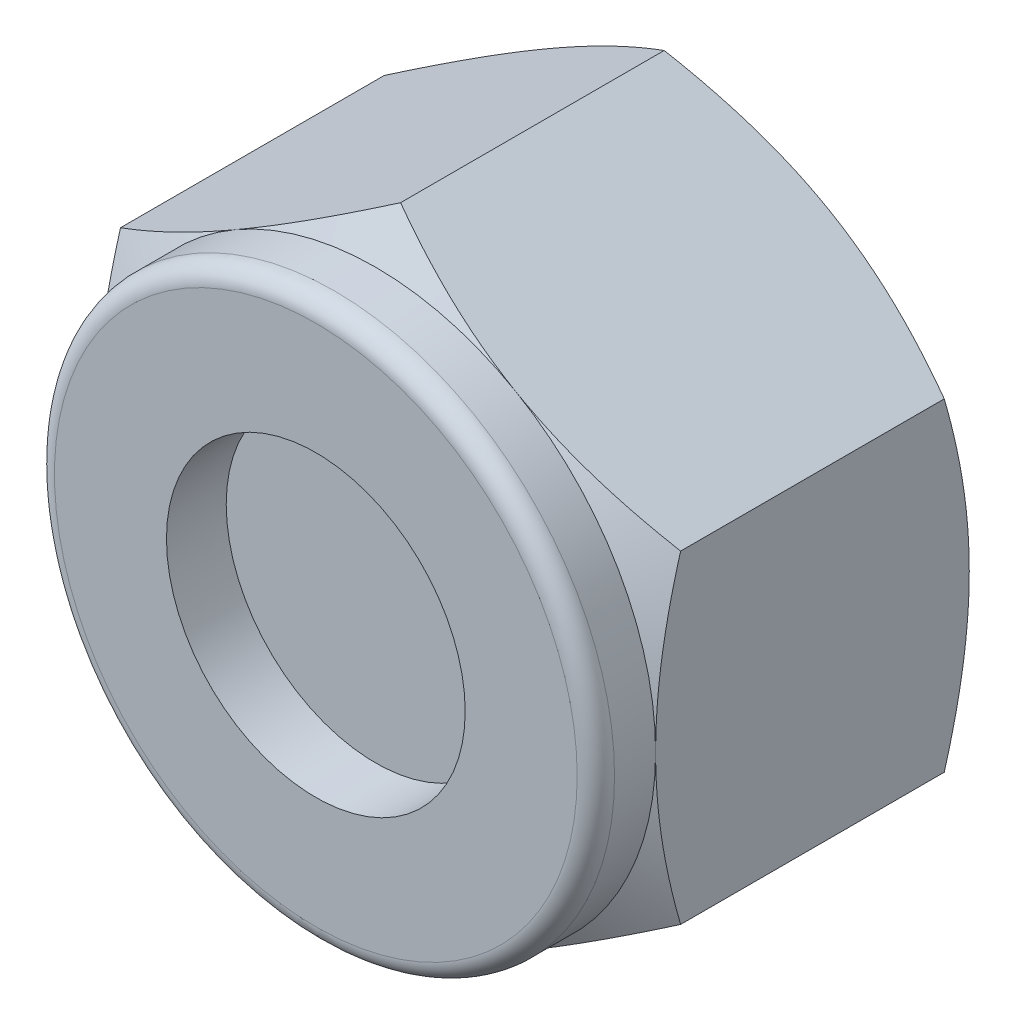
ISO-10303-21;
HEADER;
FILE_DESCRIPTION(('STEP AP214'),'2;1');
FILE_NAME('part.step','',(''),(''),'','','');
FILE_SCHEMA(('AUTOMOTIVE_DESIGN { 1 0 10303 214 1 1 1 1 }'));
ENDSEC;
DATA;
#1=APPLICATION_CONTEXT('core data for automotive mechanical design processes');
#2=APPLICATION_PROTOCOL_DEFINITION('international standard','automotive_design',2000,#1);
#3=PRODUCT_CONTEXT('',#1,'mechanical');
#4=PRODUCT('Part','Part','',(#3));
#5=PRODUCT_RELATED_PRODUCT_CATEGORY('part','',(#4));
#6=PRODUCT_DEFINITION_FORMATION('','',#4);
#7=PRODUCT_DEFINITION_CONTEXT('part definition',#1,'design');
#8=PRODUCT_DEFINITION('design','',#6,#7);
#9=PRODUCT_DEFINITION_SHAPE('','',#8);
#10=(LENGTH_UNIT() NAMED_UNIT(*) SI_UNIT(.MILLI.,.METRE.));
#11=(NAMED_UNIT(*) PLANE_ANGLE_UNIT() SI_UNIT($,.RADIAN.));
#12=(NAMED_UNIT(*) SI_UNIT($,.STERADIAN.) SOLID_ANGLE_UNIT());
#13=UNCERTAINTY_MEASURE_WITH_UNIT(LENGTH_MEASURE(1.E-05),#10,'distance_accuracy_value','');
#14=(GEOMETRIC_REPRESENTATION_CONTEXT(3) GLOBAL_UNCERTAINTY_ASSIGNED_CONTEXT((#13)) GLOBAL_UNIT_ASSIGNED_CONTEXT((#10,
#11,#12)) REPRESENTATION_CONTEXT('',''));
#15=CARTESIAN_POINT('',(0.,0.,0.));
#16=DIRECTION('',(0.,0.,1.));
#17=DIRECTION('',(1.,0.,0.));
#18=AXIS2_PLACEMENT_3D('',#15,#16,#17);
#19=CARTESIAN_POINT('',(0.,0.,10.));
#20=DIRECTION('',(0.,0.,-1.));
#21=DIRECTION('',(-1.,0.,0.));
#22=AXIS2_PLACEMENT_3D('',#19,#20,#21);
#23=CYLINDRICAL_SURFACE('',#22,7.5);
#24=CARTESIAN_POINT('',(0.,0.,9.5));
#25=DIRECTION('',(0.,0.,1.));
#26=DIRECTION('',(1.,0.,0.));
#27=AXIS2_PLACEMENT_3D('',#24,#25,#26);
#28=CIRCLE('',#27,7.5);
#29=CARTESIAN_POINT('',(7.5,0.,9.5));
#30=VERTEX_POINT('',#29);
#31=EDGE_CURVE('E11',#30,#30,#28,.F.);
#32=ORIENTED_EDGE('',*,*,#31,.T.);
#33=EDGE_LOOP('',(#32));
#34=FACE_BOUND('',#33,.T.);
#35=CARTESIAN_POINT('',(0.,0.,8.4));
#36=DIRECTION('',(0.,0.,-1.));
#37=DIRECTION('',(-1.,0.,0.));
#38=AXIS2_PLACEMENT_3D('',#35,#36,#37);
#39=CIRCLE('',#38,7.5);
#40=CARTESIAN_POINT('',(-7.5,0.,8.4));
#41=VERTEX_POINT('',#40);
#42=CARTESIAN_POINT('',(-3.75000000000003,6.49519052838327,8.4));
#43=VERTEX_POINT('',#42);
#44=EDGE_CURVE('E298',#41,#43,#39,.T.);
#45=ORIENTED_EDGE('',*,*,#44,.F.);
#46=CARTESIAN_POINT('',(-3.75000000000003,-6.49519052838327,8.4));
#47=VERTEX_POINT('',#46);
#48=EDGE_CURVE('E289',#47,#41,#39,.T.);
#49=ORIENTED_EDGE('',*,*,#48,.F.);
#50=CARTESIAN_POINT('',(3.75000000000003,-6.49519052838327,8.4));
#51=VERTEX_POINT('',#50);
#52=EDGE_CURVE('E297',#51,#47,#39,.T.);
#53=ORIENTED_EDGE('',*,*,#52,.F.);
#54=CARTESIAN_POINT('',(7.5,0.,8.4));
#55=VERTEX_POINT('',#54);
#56=EDGE_CURVE('E340',#55,#51,#39,.T.);
#57=ORIENTED_EDGE('',*,*,#56,.F.);
#58=CARTESIAN_POINT('',(3.75000000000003,6.49519052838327,8.4));
#59=VERTEX_POINT('',#58);
#60=EDGE_CURVE('E517',#59,#55,#39,.T.);
#61=ORIENTED_EDGE('',*,*,#60,.F.);
#62=EDGE_CURVE('E326',#43,#59,#39,.T.);
#63=ORIENTED_EDGE('',*,*,#62,.F.);
#64=EDGE_LOOP('',(#45,#49,#53,#57,#61,#63));
#65=FACE_BOUND('',#64,.T.);
#66=ADVANCED_FACE('F29',(#34,#65),#23,.T.);
#67=CARTESIAN_POINT('',(0.,0.,10.));
#68=DIRECTION('',(0.,0.,-1.));
#69=DIRECTION('',(-1.,0.,0.));
#70=AXIS2_PLACEMENT_3D('',#67,#68,#69);
#71=CYLINDRICAL_SURFACE('',#70,4.);
#72=CARTESIAN_POINT('',(0.,0.,10.));
#73=DIRECTION('',(0.,0.,1.));
#74=DIRECTION('',(1.,0.,0.));
#75=AXIS2_PLACEMENT_3D('',#72,#73,#74);
#76=CIRCLE('',#75,4.);
#77=CARTESIAN_POINT('',(4.,0.,10.));
#78=VERTEX_POINT('',#77);
#79=EDGE_CURVE('E146',#78,#78,#76,.T.);
#80=ORIENTED_EDGE('',*,*,#79,.T.);
#81=EDGE_LOOP('',(#80));
#82=FACE_BOUND('',#81,.T.);
#83=CARTESIAN_POINT('',(0.,0.,8.4));
#84=DIRECTION('',(0.,0.,-1.));
#85=DIRECTION('',(-1.,0.,0.));
#86=AXIS2_PLACEMENT_3D('',#83,#84,#85);
#87=CIRCLE('',#86,4.);
#88=CARTESIAN_POINT('',(-4.,0.,8.4));
#89=VERTEX_POINT('',#88);
#90=EDGE_CURVE('E285',#89,#89,#87,.T.);
#91=ORIENTED_EDGE('',*,*,#90,.T.);
#92=EDGE_LOOP('',(#91));
#93=FACE_BOUND('',#92,.T.);
#94=ADVANCED_FACE('F314',(#82,#93),#71,.F.);
#95=CARTESIAN_POINT('',(0.,0.,10.));
#96=DIRECTION('',(0.,0.,1.));
#97=DIRECTION('',(1.,0.,0.));
#98=AXIS2_PLACEMENT_3D('',#95,#96,#97);
#99=PLANE('',#98);
#100=CARTESIAN_POINT('',(0.,0.,10.));
#101=DIRECTION('',(0.,0.,1.));
#102=DIRECTION('',(1.,0.,0.));
#103=AXIS2_PLACEMENT_3D('',#100,#101,#102);
#104=CIRCLE('',#103,7.);
#105=CARTESIAN_POINT('',(7.,0.,10.));
#106=VERTEX_POINT('',#105);
#107=EDGE_CURVE('E36',#106,#106,#104,.T.);
#108=ORIENTED_EDGE('',*,*,#107,.T.);
#109=EDGE_LOOP('',(#108));
#110=FACE_BOUND('',#109,.T.);
#111=ORIENTED_EDGE('',*,*,#79,.F.);
#112=EDGE_LOOP('',(#111));
#113=FACE_BOUND('',#112,.T.);
#114=ADVANCED_FACE('F303',(#110,#113),#99,.T.);
#115=CARTESIAN_POINT('',(-14.9999999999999,0.,8.4));
#116=DIRECTION('',(0.,0.,-1.));
#117=DIRECTION('',(-1.,0.,0.));
#118=AXIS2_PLACEMENT_3D('',#115,#116,#117);
#119=PLANE('',#118);
#120=ORIENTED_EDGE('',*,*,#90,.F.);
#121=EDGE_LOOP('',(#120));
#122=FACE_BOUND('',#121,.T.);
#123=ADVANCED_FACE('F357',(#122),#119,.F.);
#124=CARTESIAN_POINT('',(0.,0.,5.2245735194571));
#125=DIRECTION('',(0.,0.,-1.));
#126=DIRECTION('',(-1.,0.,0.));
#127=AXIS2_PLACEMENT_3D('',#124,#125,#126);
#128=CONICAL_SURFACE('',#127,13.,1.0471975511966);
#129=CARTESIAN_POINT('',(-7.49999999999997,-11.8353110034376,4.64053315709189));
#130=CARTESIAN_POINT('',(-7.49999999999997,-11.5059778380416,4.80109906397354));
#131=CARTESIAN_POINT('',(-7.49999999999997,-11.1759102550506,4.96018336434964));
#132=CARTESIAN_POINT('',(-7.49999999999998,-10.513916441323,5.27455938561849));
#133=CARTESIAN_POINT('',(-7.49999999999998,-10.1819899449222,5.42985054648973));
#134=CARTESIAN_POINT('',(-7.49999999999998,-9.51427396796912,5.73654919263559));
#135=CARTESIAN_POINT('',(-7.49999999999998,-9.17847340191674,5.88793262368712));
#136=CARTESIAN_POINT('',(-7.49999999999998,-8.50427203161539,6.18477140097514));
#137=CARTESIAN_POINT('',(-7.49999999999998,-8.1658713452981,6.33022701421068));
#138=CARTESIAN_POINT('',(-7.49999999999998,-7.47423621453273,6.61852702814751));
#139=CARTESIAN_POINT('',(-7.49999999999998,-7.12089197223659,6.76110942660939));
#140=CARTESIAN_POINT('',(-7.49999999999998,-6.41014637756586,7.03596896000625));
#141=CARTESIAN_POINT('',(-7.49999999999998,-6.05274458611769,7.16824496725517));
#142=CARTESIAN_POINT('',(-7.49999999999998,-5.3339166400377,7.41916746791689));
#143=CARTESIAN_POINT('',(-7.49999999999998,-4.97249963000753,7.53783988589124));
#144=CARTESIAN_POINT('',(-7.49999999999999,-4.24449734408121,7.75788377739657));
#145=CARTESIAN_POINT('',(-7.49999999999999,-3.87791366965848,7.85926048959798));
#146=CARTESIAN_POINT('',(-7.49999999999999,-3.14139472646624,8.03942667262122));
#147=CARTESIAN_POINT('',(-7.49999999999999,-2.77149219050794,8.11834642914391));
#148=CARTESIAN_POINT('',(-7.49999999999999,-2.21311238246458,8.21657739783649));
#149=CARTESIAN_POINT('',(-7.49999999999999,-2.02638580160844,8.24596420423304));
#150=CARTESIAN_POINT('',(-7.49999999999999,-1.65193680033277,8.29745076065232));
#151=CARTESIAN_POINT('',(-7.49999999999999,-1.46421447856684,8.31955121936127));
#152=CARTESIAN_POINT('',(-7.49999999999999,-1.09056588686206,8.35573656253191));
#153=CARTESIAN_POINT('',(-7.49999999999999,-0.904649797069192,8.36992611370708));
#154=CARTESIAN_POINT('',(-7.49999999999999,-0.532383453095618,8.39042247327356));
#155=CARTESIAN_POINT('',(-7.49999999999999,-0.346033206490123,8.39672941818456));
#156=CARTESIAN_POINT('',(-7.49999999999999,0.0267671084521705,8.4013091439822));
#157=CARTESIAN_POINT('',(-7.49999999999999,0.213217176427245,8.39958195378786));
#158=CARTESIAN_POINT('',(-7.49999999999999,0.58587403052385,8.38813791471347));
#159=CARTESIAN_POINT('',(-7.49999999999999,0.772080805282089,8.37842070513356));
#160=CARTESIAN_POINT('',(-7.49999999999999,1.21356317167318,8.34612022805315));
#161=CARTESIAN_POINT('',(-7.49999999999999,1.46859186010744,8.3200816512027));
#162=CARTESIAN_POINT('',(-7.5,1.97687612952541,8.25439255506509));
#163=CARTESIAN_POINT('',(-7.5,2.23013148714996,8.21474035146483));
#164=CARTESIAN_POINT('',(-7.5,2.98688160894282,8.07745582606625));
#165=CARTESIAN_POINT('',(-7.5,3.4871060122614,7.96151677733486));
#166=CARTESIAN_POINT('',(-7.5,4.23534945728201,7.75894108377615));
#167=CARTESIAN_POINT('',(-7.5,4.48720749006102,7.68565475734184));
#168=CARTESIAN_POINT('',(-7.5,4.98848200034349,7.53108602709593));
#169=CARTESIAN_POINT('',(-7.5,5.23789846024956,7.44980356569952));
#170=CARTESIAN_POINT('',(-7.5,5.73436090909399,7.28057821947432));
#171=CARTESIAN_POINT('',(-7.5,5.98140755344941,7.19263723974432));
#172=CARTESIAN_POINT('',(-7.5,6.47342859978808,7.01116763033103));
#173=CARTESIAN_POINT('',(-7.5,6.71840303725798,6.91763909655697));
#174=CARTESIAN_POINT('',(-7.5,7.33598157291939,6.67505952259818));
#175=CARTESIAN_POINT('',(-7.50000000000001,7.70735302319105,6.52287454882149));
#176=CARTESIAN_POINT('',(-7.50000000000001,8.44656287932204,6.21012528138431));
#177=CARTESIAN_POINT('',(-7.50000000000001,8.81440097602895,6.04956026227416));
#178=CARTESIAN_POINT('',(-7.50000000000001,9.54727427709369,5.72187695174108));
#179=CARTESIAN_POINT('',(-7.50000000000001,9.91230857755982,5.55475664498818));
#180=CARTESIAN_POINT('',(-7.50000000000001,10.6399735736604,5.21540661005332));
#181=CARTESIAN_POINT('',(-7.50000000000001,11.0026043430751,5.04317703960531));
#182=CARTESIAN_POINT('',(-7.50000000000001,11.7263998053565,4.69440091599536));
#183=CARTESIAN_POINT('',(-7.50000000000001,12.0875617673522,4.51784870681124));
#184=CARTESIAN_POINT('',(-7.50000000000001,12.8082552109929,4.16144684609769));
#185=CARTESIAN_POINT('',(-7.50000000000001,13.1677866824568,3.98159717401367));
#186=CARTESIAN_POINT('',(-7.50000000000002,13.8854257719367,3.61924007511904));
#187=CARTESIAN_POINT('',(-7.50000000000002,14.2435336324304,3.43673312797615));
#188=CARTESIAN_POINT('',(-7.50000000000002,14.9586085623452,3.06949663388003));
#189=CARTESIAN_POINT('',(-7.50000000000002,15.3155756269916,2.8847670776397));
#190=CARTESIAN_POINT('',(-7.50000000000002,16.3172991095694,2.36309010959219));
#191=CARTESIAN_POINT('',(-7.50000000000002,16.9609630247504,2.02404516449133));
#192=CARTESIAN_POINT('',(-7.50000000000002,18.245962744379,1.34150647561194));
#193=CARTESIAN_POINT('',(-7.50000000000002,18.8872984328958,0.998012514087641));
#194=CARTESIAN_POINT('',(-7.50000000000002,20.1662212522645,0.308722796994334));
#195=CARTESIAN_POINT('',(-7.50000000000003,20.8038138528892,-0.0370628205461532));
#196=CARTESIAN_POINT('',(-7.50000000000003,22.0775296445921,-0.731227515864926));
#197=CARTESIAN_POINT('',(-7.50000000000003,22.7136529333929,-1.07960641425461));
#198=CARTESIAN_POINT('',(-7.50000000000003,23.3492483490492,-1.4289383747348));
#199=B_SPLINE_CURVE_WITH_KNOTS('',3,(#129,#130,#131,#132,#133,#134,#135,#136,#137,#138,#139,
#140,#141,#142,#143,#144,#145,#146,#147,#148,#149,#150,#151,#152,#153,#154,#155,#156,#157,#158,
#159,#160,#161,#162,#163,#164,#165,#166,#167,#168,#169,#170,#171,#172,#173,#174,#175,#176,#177,
#178,#179,#180,#181,#182,#183,#184,#185,#186,#187,#188,#189,#190,#191,#192,#193,#194,#195,#196,
#197,#198),.UNSPECIFIED.,.F.,.F.,(4,2,2,2,2,2,2,2,2,2,2,2,2,2,2,2,2,2,2,2,2,2,2,2,2,2,2,2,2,2,2,
2,2,2,4),(0.,1.09918292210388,2.19852715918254,3.30351989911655,4.40846281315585,
5.5514201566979,6.69450238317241,7.83536867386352,8.97588879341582,10.1096505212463,
10.676605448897,11.2435052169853,11.8027148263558,12.3619147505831,12.9211126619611,
13.4803358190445,14.2489692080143,15.0176977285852,16.5559171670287,17.3427576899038,
18.1296038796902,18.9162257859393,19.7028341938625,20.9067203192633,22.1107108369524,
23.3150744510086,24.5194009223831,25.7253976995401,26.9314019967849,28.137191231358,
29.3429855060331,31.5254556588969,33.7080330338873,35.8839922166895,38.0598022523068),.UNSPECIFIED.);
#200=CARTESIAN_POINT('',(-7.49999999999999,-4.33012701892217,7.73012701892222));
#201=VERTEX_POINT('',#200);
#202=EDGE_CURVE('E225',#41,#201,#199,.F.);
#203=ORIENTED_EDGE('',*,*,#202,.T.);
#204=CARTESIAN_POINT('',(-7.50019999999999,-4.33001154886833,7.73006035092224));
#205=CARTESIAN_POINT('',(-7.33534165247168,-4.42519256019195,7.78500472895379));
#206=CARTESIAN_POINT('',(-7.16986863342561,-4.52072845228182,7.83745551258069));
#207=CARTESIAN_POINT('',(-6.83757877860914,-4.7125760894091,7.93668310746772));
#208=CARTESIAN_POINT('',(-6.67076139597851,-4.8088881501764,7.98345747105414));
#209=CARTESIAN_POINT('',(-6.16763831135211,-5.09936639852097,8.11434781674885));
#210=CARTESIAN_POINT('',(-5.82934661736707,-5.29467919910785,8.18879669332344));
#211=CARTESIAN_POINT('',(-5.32309925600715,-5.58696124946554,8.2760966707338));
#212=CARTESIAN_POINT('',(-5.15665618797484,-5.68305719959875,8.30096588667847));
#213=CARTESIAN_POINT('',(-4.82301799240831,-5.87568330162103,8.342667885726));
#214=CARTESIAN_POINT('',(-4.65582293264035,-5.97221341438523,8.35950137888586));
#215=CARTESIAN_POINT('',(-4.32114243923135,-6.16544128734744,8.38470292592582));
#216=CARTESIAN_POINT('',(-4.15365755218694,-6.26213873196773,8.39308058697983));
#217=CARTESIAN_POINT('',(-3.81854232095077,-6.45561760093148,8.40119981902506));
#218=CARTESIAN_POINT('',(-3.65091198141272,-6.55239902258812,8.40094165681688));
#219=CARTESIAN_POINT('',(-3.19166219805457,-6.81754700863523,8.38836399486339));
#220=CARTESIAN_POINT('',(-2.90019309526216,-6.98582677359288,8.36725033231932));
#221=CARTESIAN_POINT('',(-2.3191907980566,-7.32126860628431,8.30029942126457));
#222=CARTESIAN_POINT('',(-2.02965964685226,-7.48842949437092,8.25443929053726));
#223=CARTESIAN_POINT('',(-1.44748813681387,-7.82454637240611,8.13980254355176));
#224=CARTESIAN_POINT('',(-1.15492123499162,-7.99345995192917,8.07054023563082));
#225=CARTESIAN_POINT('',(-0.574150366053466,-8.32876816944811,7.91334284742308));
#226=CARTESIAN_POINT('',(-0.28593896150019,-8.49516710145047,7.8254446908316));
#227=CARTESIAN_POINT('',(0.000200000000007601,-8.66036950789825,7.73006035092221));
#228=B_SPLINE_CURVE_WITH_KNOTS('',3,(#204,#205,#206,#207,#208,#209,#210,#211,#212,#213,#214,
#215,#216,#217,#218,#219,#220,#221,#222,#223,#224,#225,#226,#227),.UNSPECIFIED.,.F.,.F.,(4,2,2,
2,2,2,2,2,2,2,2,4),(0.,0.594350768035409,1.18895691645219,2.38063993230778,2.96188692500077,
3.5430825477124,4.12361709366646,4.70413370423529,5.7147367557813,6.7262758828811,
7.76024925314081,8.79219281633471),.UNSPECIFIED.);
#229=EDGE_CURVE('E231',#201,#47,#228,.T.);
#230=ORIENTED_EDGE('',*,*,#229,.T.);
#231=ORIENTED_EDGE('',*,*,#48,.T.);
#232=EDGE_LOOP('',(#203,#230,#231));
#233=FACE_BOUND('',#232,.T.);
#234=ADVANCED_FACE('F331',(#233),#128,.T.);
#235=CARTESIAN_POINT('',(0.,-8.66025403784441,7.73012701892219));
#236=VERTEX_POINT('',#235);
#237=EDGE_CURVE('E220',#47,#236,#228,.T.);
#238=ORIENTED_EDGE('',*,*,#237,.T.);
#239=CARTESIAN_POINT('',(-0.000199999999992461,-8.66036950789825,7.73006035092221));
#240=CARTESIAN_POINT('',(0.16465834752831,-8.56518849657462,7.78500472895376));
#241=CARTESIAN_POINT('',(0.330131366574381,-8.46965260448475,7.83745551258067));
#242=CARTESIAN_POINT('',(0.662421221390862,-8.27780496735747,7.9366831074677));
#243=CARTESIAN_POINT('',(0.829238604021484,-8.18149290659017,7.98345747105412));
#244=CARTESIAN_POINT('',(1.33236168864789,-7.8910146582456,8.11434781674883));
#245=CARTESIAN_POINT('',(1.67065338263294,-7.69570185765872,8.18879669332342));
#246=CARTESIAN_POINT('',(2.17690074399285,-7.40341980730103,8.27609667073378));
#247=CARTESIAN_POINT('',(2.34334381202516,-7.30732385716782,8.30096588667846));
#248=CARTESIAN_POINT('',(2.6769820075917,-7.11469775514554,8.34266788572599));
#249=CARTESIAN_POINT('',(2.84417706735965,-7.01816764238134,8.35950137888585));
#250=CARTESIAN_POINT('',(3.17885756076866,-6.82493976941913,8.38470292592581));
#251=CARTESIAN_POINT('',(3.34634244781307,-6.72824232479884,8.39308058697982));
#252=CARTESIAN_POINT('',(3.68145767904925,-6.53476345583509,8.40119981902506));
#253=CARTESIAN_POINT('',(3.8490880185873,-6.43798203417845,8.40094165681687));
#254=CARTESIAN_POINT('',(4.30833780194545,-6.17283404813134,8.38836399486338));
#255=CARTESIAN_POINT('',(4.59980690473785,-6.00455428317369,8.36725033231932));
#256=CARTESIAN_POINT('',(5.18080920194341,-5.66911245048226,8.30029942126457));
#257=CARTESIAN_POINT('',(5.47034035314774,-5.50195156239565,8.25443929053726));
#258=CARTESIAN_POINT('',(6.05251186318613,-5.16583468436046,8.13980254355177));
#259=CARTESIAN_POINT('',(6.34507876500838,-4.99692110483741,8.07054023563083));
#260=CARTESIAN_POINT('',(6.92584963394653,-4.66161288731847,7.91334284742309));
#261=CARTESIAN_POINT('',(7.21406103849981,-4.49521395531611,7.82544469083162));
#262=CARTESIAN_POINT('',(7.5002,-4.33001154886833,7.73006035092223));
#263=B_SPLINE_CURVE_WITH_KNOTS('',3,(#239,#240,#241,#242,#243,#244,#245,#246,#247,#248,#249,
#250,#251,#252,#253,#254,#255,#256,#257,#258,#259,#260,#261,#262),.UNSPECIFIED.,.F.,.F.,(4,2,2,
2,2,2,2,2,2,2,2,4),(0.,0.594350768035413,1.1889569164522,2.38063993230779,2.96188692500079,
3.54308254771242,4.12361709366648,4.70413370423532,5.71473675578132,6.72627588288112,
7.76024925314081,8.79219281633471),.UNSPECIFIED.);
#264=EDGE_CURVE('E334',#236,#51,#263,.T.);
#265=ORIENTED_EDGE('',*,*,#264,.T.);
#266=ORIENTED_EDGE('',*,*,#52,.T.);
#267=EDGE_LOOP('',(#238,#265,#266));
#268=FACE_BOUND('',#267,.T.);
#269=ADVANCED_FACE('F356',(#268),#128,.T.);
#270=CARTESIAN_POINT('',(7.5,-4.33012701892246,7.7301270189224));
#271=VERTEX_POINT('',#270);
#272=EDGE_CURVE('E202',#51,#271,#263,.T.);
#273=ORIENTED_EDGE('',*,*,#272,.T.);
#274=CARTESIAN_POINT('',(7.50000000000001,-11.8353110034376,4.64053315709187));
#275=CARTESIAN_POINT('',(7.50000000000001,-11.5059778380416,4.80109906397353));
#276=CARTESIAN_POINT('',(7.50000000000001,-11.1759102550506,4.96018336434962));
#277=CARTESIAN_POINT('',(7.50000000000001,-10.513916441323,5.27455938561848));
#278=CARTESIAN_POINT('',(7.50000000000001,-10.1819899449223,5.42985054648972));
#279=CARTESIAN_POINT('',(7.50000000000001,-9.51427396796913,5.73654919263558));
#280=CARTESIAN_POINT('',(7.50000000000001,-9.17847340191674,5.88793262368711));
#281=CARTESIAN_POINT('',(7.50000000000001,-8.50427203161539,6.18477140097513));
#282=CARTESIAN_POINT('',(7.50000000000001,-8.16587134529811,6.33022701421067));
#283=CARTESIAN_POINT('',(7.50000000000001,-7.47423621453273,6.6185270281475));
#284=CARTESIAN_POINT('',(7.5,-7.12089197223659,6.76110942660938));
#285=CARTESIAN_POINT('',(7.5,-6.41014637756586,7.03596896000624));
#286=CARTESIAN_POINT('',(7.5,-6.05274458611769,7.16824496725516));
#287=CARTESIAN_POINT('',(7.5,-5.3339166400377,7.41916746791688));
#288=CARTESIAN_POINT('',(7.5,-4.97249963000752,7.53783988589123));
#289=CARTESIAN_POINT('',(7.5,-4.2444973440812,7.75788377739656));
#290=CARTESIAN_POINT('',(7.5,-3.87791366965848,7.85926048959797));
#291=CARTESIAN_POINT('',(7.5,-3.14139472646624,8.03942667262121));
#292=CARTESIAN_POINT('',(7.5,-2.77149219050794,8.1183464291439));
#293=CARTESIAN_POINT('',(7.5,-2.21311238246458,8.21657739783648));
#294=CARTESIAN_POINT('',(7.5,-2.02638580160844,8.24596420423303));
#295=CARTESIAN_POINT('',(7.5,-1.65193680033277,8.29745076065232));
#296=CARTESIAN_POINT('',(7.5,-1.46421447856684,8.31955121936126));
#297=CARTESIAN_POINT('',(7.5,-1.09056588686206,8.35573656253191));
#298=CARTESIAN_POINT('',(7.5,-0.904649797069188,8.36992611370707));
#299=CARTESIAN_POINT('',(7.5,-0.532383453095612,8.39042247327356));
#300=CARTESIAN_POINT('',(7.5,-0.346033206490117,8.39672941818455));
#301=CARTESIAN_POINT('',(7.5,0.0267671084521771,8.40130914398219));
#302=CARTESIAN_POINT('',(7.5,0.213217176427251,8.39958195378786));
#303=CARTESIAN_POINT('',(7.5,0.585874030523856,8.38813791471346));
#304=CARTESIAN_POINT('',(7.5,0.772080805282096,8.37842070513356));
#305=CARTESIAN_POINT('',(7.5,1.21356317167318,8.34612022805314));
#306=CARTESIAN_POINT('',(7.5,1.46859186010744,8.32008165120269));
#307=CARTESIAN_POINT('',(7.5,1.97687612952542,8.25439255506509));
#308=CARTESIAN_POINT('',(7.5,2.23013148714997,8.21474035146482));
#309=CARTESIAN_POINT('',(7.5,2.98688160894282,8.07745582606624));
#310=CARTESIAN_POINT('',(7.5,3.48710601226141,7.96151677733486));
#311=CARTESIAN_POINT('',(7.5,4.23534945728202,7.75894108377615));
#312=CARTESIAN_POINT('',(7.5,4.48720749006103,7.68565475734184));
#313=CARTESIAN_POINT('',(7.5,4.9884820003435,7.53108602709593));
#314=CARTESIAN_POINT('',(7.5,5.23789846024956,7.44980356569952));
#315=CARTESIAN_POINT('',(7.5,5.73436090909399,7.28057821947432));
#316=CARTESIAN_POINT('',(7.5,5.98140755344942,7.19263723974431));
#317=CARTESIAN_POINT('',(7.5,6.47342859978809,7.01116763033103));
#318=CARTESIAN_POINT('',(7.5,6.71840303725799,6.91763909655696));
#319=CARTESIAN_POINT('',(7.5,7.3359815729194,6.67505952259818));
#320=CARTESIAN_POINT('',(7.5,7.70735302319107,6.52287454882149));
#321=CARTESIAN_POINT('',(7.5,8.44656287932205,6.2101252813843));
#322=CARTESIAN_POINT('',(7.5,8.81440097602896,6.04956026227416));
#323=CARTESIAN_POINT('',(7.5,9.54727427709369,5.72187695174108));
#324=CARTESIAN_POINT('',(7.5,9.91230857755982,5.55475664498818));
#325=CARTESIAN_POINT('',(7.5,10.6399735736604,5.21540661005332));
#326=CARTESIAN_POINT('',(7.5,11.0026043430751,5.04317703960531));
#327=CARTESIAN_POINT('',(7.5,11.7263998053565,4.69440091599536));
#328=CARTESIAN_POINT('',(7.5,12.0875617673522,4.51784870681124));
#329=CARTESIAN_POINT('',(7.5,12.8082552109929,4.16144684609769));
#330=CARTESIAN_POINT('',(7.5,13.1677866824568,3.98159717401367));
#331=CARTESIAN_POINT('',(7.5,13.8854257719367,3.61924007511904));
#332=CARTESIAN_POINT('',(7.5,14.2435336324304,3.43673312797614));
#333=CARTESIAN_POINT('',(7.5,14.9586085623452,3.06949663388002));
#334=CARTESIAN_POINT('',(7.5,15.3155756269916,2.8847670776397));
#335=CARTESIAN_POINT('',(7.5,16.3172991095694,2.36309010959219));
#336=CARTESIAN_POINT('',(7.49999999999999,16.9609630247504,2.02404516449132));
#337=CARTESIAN_POINT('',(7.49999999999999,18.2459627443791,1.34150647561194));
#338=CARTESIAN_POINT('',(7.49999999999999,18.8872984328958,0.998012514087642));
#339=CARTESIAN_POINT('',(7.49999999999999,20.1662212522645,0.308722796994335));
#340=CARTESIAN_POINT('',(7.49999999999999,20.8038138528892,-0.0370628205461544));
#341=CARTESIAN_POINT('',(7.49999999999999,22.0775296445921,-0.731227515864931));
#342=CARTESIAN_POINT('',(7.49999999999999,22.7136529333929,-1.07960641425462));
#343=CARTESIAN_POINT('',(7.49999999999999,23.3492483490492,-1.4289383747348));
#344=B_SPLINE_CURVE_WITH_KNOTS('',3,(#274,#275,#276,#277,#278,#279,#280,#281,#282,#283,#284,
#285,#286,#287,#288,#289,#290,#291,#292,#293,#294,#295,#296,#297,#298,#299,#300,#301,#302,#303,
#304,#305,#306,#307,#308,#309,#310,#311,#312,#313,#314,#315,#316,#317,#318,#319,#320,#321,#322,
#323,#324,#325,#326,#327,#328,#329,#330,#331,#332,#333,#334,#335,#336,#337,#338,#339,#340,#341,
#342,#343),.UNSPECIFIED.,.F.,.F.,(4,2,2,2,2,2,2,2,2,2,2,2,2,2,2,2,2,2,2,2,2,2,2,2,2,2,2,2,2,2,2,
2,2,2,4),(0.,1.09918292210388,2.19852715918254,3.30351989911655,4.40846281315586,
5.55142015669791,6.69450238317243,7.83536867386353,8.97588879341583,10.1096505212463,
10.676605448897,11.2435052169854,11.8027148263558,12.3619147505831,12.9211126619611,
13.4803358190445,14.2489692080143,15.0176977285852,16.5559171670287,17.3427576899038,
18.1296038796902,18.9162257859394,19.7028341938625,20.9067203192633,22.1107108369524,
23.3150744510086,24.5194009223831,25.7253976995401,26.9314019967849,28.137191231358,
29.3429855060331,31.5254556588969,33.7080330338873,35.8839922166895,38.0598022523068),.UNSPECIFIED.);
#345=EDGE_CURVE('E51',#271,#55,#344,.T.);
#346=ORIENTED_EDGE('',*,*,#345,.T.);
#347=ORIENTED_EDGE('',*,*,#56,.T.);
#348=EDGE_LOOP('',(#273,#346,#347));
#349=FACE_BOUND('',#348,.T.);
#350=ADVANCED_FACE('F338',(#349),#128,.T.);
#351=CARTESIAN_POINT('',(7.5,4.33012701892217,7.73012701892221));
#352=VERTEX_POINT('',#351);
#353=EDGE_CURVE('E190',#55,#352,#344,.T.);
#354=ORIENTED_EDGE('',*,*,#353,.T.);
#355=CARTESIAN_POINT('',(7.5002,4.33001154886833,7.73006035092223));
#356=CARTESIAN_POINT('',(7.3353416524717,4.42519256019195,7.78500472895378));
#357=CARTESIAN_POINT('',(7.16986863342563,4.52072845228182,7.83745551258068));
#358=CARTESIAN_POINT('',(6.83757877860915,4.7125760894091,7.93668310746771));
#359=CARTESIAN_POINT('',(6.67076139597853,4.8088881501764,7.98345747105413));
#360=CARTESIAN_POINT('',(6.16763831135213,5.09936639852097,8.11434781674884));
#361=CARTESIAN_POINT('',(5.82934661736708,5.29467919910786,8.18879669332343));
#362=CARTESIAN_POINT('',(5.32309925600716,5.58696124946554,8.27609667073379));
#363=CARTESIAN_POINT('',(5.15665618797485,5.68305719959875,8.30096588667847));
#364=CARTESIAN_POINT('',(4.82301799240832,5.87568330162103,8.342667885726));
#365=CARTESIAN_POINT('',(4.65582293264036,5.97221341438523,8.35950137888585));
#366=CARTESIAN_POINT('',(4.32114243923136,6.16544128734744,8.38470292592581));
#367=CARTESIAN_POINT('',(4.15365755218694,6.26213873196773,8.39308058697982));
#368=CARTESIAN_POINT('',(3.81854232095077,6.45561760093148,8.40119981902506));
#369=CARTESIAN_POINT('',(3.65091198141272,6.55239902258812,8.40094165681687));
#370=CARTESIAN_POINT('',(3.19166219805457,6.81754700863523,8.38836399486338));
#371=CARTESIAN_POINT('',(2.90019309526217,6.98582677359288,8.36725033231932));
#372=CARTESIAN_POINT('',(2.3191907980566,7.32126860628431,8.30029942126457));
#373=CARTESIAN_POINT('',(2.02965964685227,7.48842949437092,8.25443929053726));
#374=CARTESIAN_POINT('',(1.44748813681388,7.82454637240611,8.13980254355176));
#375=CARTESIAN_POINT('',(1.15492123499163,7.99345995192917,8.07054023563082));
#376=CARTESIAN_POINT('',(0.574150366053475,8.32876816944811,7.91334284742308));
#377=CARTESIAN_POINT('',(0.285938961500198,8.49516710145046,7.8254446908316));
#378=CARTESIAN_POINT('',(-0.00019999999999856,8.66036950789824,7.73006035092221));
#379=B_SPLINE_CURVE_WITH_KNOTS('',3,(#355,#356,#357,#358,#359,#360,#361,#362,#363,#364,#365,
#366,#367,#368,#369,#370,#371,#372,#373,#374,#375,#376,#377,#378),.UNSPECIFIED.,.F.,.F.,(4,2,2,
2,2,2,2,2,2,2,2,4),(0.,0.59435076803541,1.18895691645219,2.38063993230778,2.96188692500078,
3.54308254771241,4.12361709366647,4.7041337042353,5.7147367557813,6.72627588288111,
7.76024925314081,8.79219281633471),.UNSPECIFIED.);
#380=EDGE_CURVE('E196',#352,#59,#379,.T.);
#381=ORIENTED_EDGE('',*,*,#380,.T.);
#382=ORIENTED_EDGE('',*,*,#60,.T.);
#383=EDGE_LOOP('',(#354,#381,#382));
#384=FACE_BOUND('',#383,.T.);
#385=ADVANCED_FACE('F212',(#384),#128,.T.);
#386=CARTESIAN_POINT('',(0.000200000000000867,8.66036950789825,7.73006035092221));
#387=CARTESIAN_POINT('',(-0.164658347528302,8.56518849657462,7.78500472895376));
#388=CARTESIAN_POINT('',(-0.330131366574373,8.46965260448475,7.83745551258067));
#389=CARTESIAN_POINT('',(-0.662421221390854,8.27780496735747,7.9366831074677));
#390=CARTESIAN_POINT('',(-0.829238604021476,8.18149290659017,7.98345747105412));
#391=CARTESIAN_POINT('',(-1.33236168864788,7.8910146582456,8.11434781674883));
#392=CARTESIAN_POINT('',(-1.67065338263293,7.69570185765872,8.18879669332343));
#393=CARTESIAN_POINT('',(-2.17690074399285,7.40341980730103,8.27609667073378));
#394=CARTESIAN_POINT('',(-2.34334381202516,7.30732385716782,8.30096588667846));
#395=CARTESIAN_POINT('',(-2.67698200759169,7.11469775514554,8.34266788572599));
#396=CARTESIAN_POINT('',(-2.84417706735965,7.01816764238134,8.35950137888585));
#397=CARTESIAN_POINT('',(-3.17885756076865,6.82493976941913,8.38470292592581));
#398=CARTESIAN_POINT('',(-3.34634244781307,6.72824232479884,8.39308058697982));
#399=CARTESIAN_POINT('',(-3.68145767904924,6.53476345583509,8.40119981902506));
#400=CARTESIAN_POINT('',(-3.84908801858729,6.43798203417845,8.40094165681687));
#401=CARTESIAN_POINT('',(-4.30833780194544,6.17283404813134,8.38836399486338));
#402=CARTESIAN_POINT('',(-4.59980690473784,6.00455428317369,8.36725033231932));
#403=CARTESIAN_POINT('',(-5.1808092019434,5.66911245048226,8.30029942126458));
#404=CARTESIAN_POINT('',(-5.47034035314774,5.50195156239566,8.25443929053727));
#405=CARTESIAN_POINT('',(-6.05251186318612,5.16583468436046,8.13980254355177));
#406=CARTESIAN_POINT('',(-6.34507876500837,4.99692110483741,8.07054023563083));
#407=CARTESIAN_POINT('',(-6.92584963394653,4.66161288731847,7.91334284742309));
#408=CARTESIAN_POINT('',(-7.2140610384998,4.49521395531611,7.82544469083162));
#409=CARTESIAN_POINT('',(-7.5002,4.33001154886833,7.73006035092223));
#410=B_SPLINE_CURVE_WITH_KNOTS('',3,(#386,#387,#388,#389,#390,#391,#392,#393,#394,#395,#396,
#397,#398,#399,#400,#401,#402,#403,#404,#405,#406,#407,#408,#409),.UNSPECIFIED.,.F.,.F.,(4,2,2,
2,2,2,2,2,2,2,2,4),(0.,0.594350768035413,1.1889569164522,2.38063993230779,2.96188692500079,
3.54308254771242,4.12361709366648,4.70413370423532,5.71473675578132,6.72627588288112,
7.76024925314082,8.79219281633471),.UNSPECIFIED.);
#411=CARTESIAN_POINT('',(0.,8.66025403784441,7.73012701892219));
#412=VERTEX_POINT('',#411);
#413=EDGE_CURVE('E43',#412,#43,#410,.T.);
#414=ORIENTED_EDGE('',*,*,#413,.T.);
#415=ORIENTED_EDGE('',*,*,#62,.T.);
#416=EDGE_CURVE('E197',#59,#412,#379,.T.);
#417=ORIENTED_EDGE('',*,*,#416,.T.);
#418=EDGE_LOOP('',(#414,#415,#417));
#419=FACE_BOUND('',#418,.T.);
#420=ADVANCED_FACE('F207',(#419),#128,.T.);
#421=CARTESIAN_POINT('',(-7.5,4.33012701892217,7.73012701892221));
#422=VERTEX_POINT('',#421);
#423=EDGE_CURVE('E232',#43,#422,#410,.T.);
#424=ORIENTED_EDGE('',*,*,#423,.T.);
#425=EDGE_CURVE('E230',#422,#41,#199,.F.);
#426=ORIENTED_EDGE('',*,*,#425,.T.);
#427=ORIENTED_EDGE('',*,*,#44,.T.);
#428=EDGE_LOOP('',(#424,#426,#427));
#429=FACE_BOUND('',#428,.T.);
#430=ADVANCED_FACE('F211',(#429),#128,.T.);
#431=CARTESIAN_POINT('',(7.5,4.33012701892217,8.4));
#432=DIRECTION('',(-0.500000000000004,-0.866025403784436,0.));
#433=DIRECTION('',(0.866025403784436,-0.500000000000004,0.));
#434=AXIS2_PLACEMENT_3D('',#431,#432,#433);
#435=PLANE('',#434);
#436=CARTESIAN_POINT('',(-0.000199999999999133,8.66036950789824,0.669939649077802));
#437=CARTESIAN_POINT('',(0.164658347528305,8.56518849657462,0.614995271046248));
#438=CARTESIAN_POINT('',(0.330131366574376,8.46965260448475,0.562544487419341));
#439=CARTESIAN_POINT('',(0.662421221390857,8.27780496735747,0.463316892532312));
#440=CARTESIAN_POINT('',(0.829238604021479,8.18149290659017,0.416542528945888));
#441=CARTESIAN_POINT('',(1.33236168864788,7.8910146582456,0.285652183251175));
#442=CARTESIAN_POINT('',(1.67065338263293,7.69570185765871,0.211203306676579));
#443=CARTESIAN_POINT('',(2.17690074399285,7.40341980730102,0.123903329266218));
#444=CARTESIAN_POINT('',(2.34334381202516,7.30732385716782,0.0990341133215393));
#445=CARTESIAN_POINT('',(2.6769820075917,7.11469775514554,0.0573321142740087));
#446=CARTESIAN_POINT('',(2.84417706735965,7.01816764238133,0.0404986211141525));
#447=CARTESIAN_POINT('',(3.17885756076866,6.82493976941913,0.0152970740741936));
#448=CARTESIAN_POINT('',(3.34634244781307,6.72824232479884,0.00691941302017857));
#449=CARTESIAN_POINT('',(3.68145767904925,6.53476345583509,-0.00119981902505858));
#450=CARTESIAN_POINT('',(3.8490880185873,6.43798203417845,-0.000941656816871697));
#451=CARTESIAN_POINT('',(4.30833780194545,6.17283404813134,0.011636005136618));
#452=CARTESIAN_POINT('',(4.59980690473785,6.00455428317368,0.0327496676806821));
#453=CARTESIAN_POINT('',(5.18080920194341,5.66911245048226,0.0997005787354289));
#454=CARTESIAN_POINT('',(5.47034035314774,5.50195156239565,0.145560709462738));
#455=CARTESIAN_POINT('',(6.05251186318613,5.16583468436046,0.260197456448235));
#456=CARTESIAN_POINT('',(6.34507876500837,4.99692110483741,0.329459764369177));
#457=CARTESIAN_POINT('',(6.92584963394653,4.66161288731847,0.486657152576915));
#458=CARTESIAN_POINT('',(7.2140610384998,4.49521395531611,0.574555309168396));
#459=CARTESIAN_POINT('',(7.5002,4.33001154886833,0.669939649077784));
#460=B_SPLINE_CURVE_WITH_KNOTS('',3,(#436,#437,#438,#439,#440,#441,#442,#443,#444,#445,#446,
#447,#448,#449,#450,#451,#452,#453,#454,#455,#456,#457,#458,#459),.UNSPECIFIED.,.F.,.F.,(4,2,2,
2,2,2,2,2,2,2,2,4),(0.,0.594350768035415,1.1889569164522,2.3806399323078,2.9618869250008,
3.54308254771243,4.12361709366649,4.70413370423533,5.71473675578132,6.72627588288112,
7.76024925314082,8.79219281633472),.UNSPECIFIED.);
#461=CARTESIAN_POINT('',(0.,8.66025403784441,0.66987298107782));
#462=VERTEX_POINT('',#461);
#463=CARTESIAN_POINT('',(3.75000000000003,6.49519052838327,0.));
#464=VERTEX_POINT('',#463);
#465=EDGE_CURVE('E132',#462,#464,#460,.T.);
#466=ORIENTED_EDGE('',*,*,#465,.F.);
#467=DIRECTION('',(0.,0.,-1.));
#468=VECTOR('',#467,1.);
#469=CARTESIAN_POINT('',(0.,8.66025403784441,8.4));
#470=LINE('',#469,#468);
#471=EDGE_CURVE('E346',#412,#462,#470,.T.);
#472=ORIENTED_EDGE('',*,*,#471,.F.);
#473=ORIENTED_EDGE('',*,*,#416,.F.);
#474=ORIENTED_EDGE('',*,*,#380,.F.);
#475=DIRECTION('',(0.,0.,-1.));
#476=VECTOR('',#475,1.);
#477=CARTESIAN_POINT('',(7.5,4.33012701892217,8.4));
#478=LINE('',#477,#476);
#479=CARTESIAN_POINT('',(7.5,4.33012701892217,0.669872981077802));
#480=VERTEX_POINT('',#479);
#481=EDGE_CURVE('E343',#352,#480,#478,.T.);
#482=ORIENTED_EDGE('',*,*,#481,.T.);
#483=EDGE_CURVE('E126',#464,#480,#460,.T.);
#484=ORIENTED_EDGE('',*,*,#483,.F.);
#485=EDGE_LOOP('',(#466,#472,#473,#474,#482,#484));
#486=FACE_BOUND('',#485,.T.);
#487=ADVANCED_FACE('F184',(#486),#435,.F.);
#488=CARTESIAN_POINT('',(7.5,4.33012701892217,8.4));
#489=DIRECTION('',(-1.,0.,0.));
#490=DIRECTION('',(0.,-1.,0.));
#491=AXIS2_PLACEMENT_3D('',#488,#489,#490);
#492=PLANE('',#491);
#493=CARTESIAN_POINT('',(7.50000000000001,-11.8353110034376,3.75946684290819));
#494=CARTESIAN_POINT('',(7.50000000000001,-11.5059778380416,3.59890093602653));
#495=CARTESIAN_POINT('',(7.50000000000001,-11.1759102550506,3.43981663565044));
#496=CARTESIAN_POINT('',(7.50000000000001,-10.5139164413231,3.12544061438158));
#497=CARTESIAN_POINT('',(7.50000000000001,-10.1819899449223,2.97014945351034));
#498=CARTESIAN_POINT('',(7.50000000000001,-9.51427396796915,2.66345080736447));
#499=CARTESIAN_POINT('',(7.50000000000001,-9.17847340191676,2.51206737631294));
#500=CARTESIAN_POINT('',(7.50000000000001,-8.50427203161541,2.21522859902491));
#501=CARTESIAN_POINT('',(7.50000000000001,-8.16587134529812,2.06977298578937));
#502=CARTESIAN_POINT('',(7.50000000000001,-7.47423621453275,1.78147297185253));
#503=CARTESIAN_POINT('',(7.5,-7.1208919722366,1.63889057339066));
#504=CARTESIAN_POINT('',(7.5,-6.41014637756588,1.36403103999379));
#505=CARTESIAN_POINT('',(7.5,-6.0527445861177,1.23175503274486));
#506=CARTESIAN_POINT('',(7.5,-5.33391664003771,0.980832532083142));
#507=CARTESIAN_POINT('',(7.5,-4.97249963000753,0.862160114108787));
#508=CARTESIAN_POINT('',(7.5,-4.24449734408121,0.642116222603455));
#509=CARTESIAN_POINT('',(7.5,-3.87791366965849,0.540739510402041));
#510=CARTESIAN_POINT('',(7.5,-3.14139472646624,0.360573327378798));
#511=CARTESIAN_POINT('',(7.5,-2.77149219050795,0.281653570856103));
#512=CARTESIAN_POINT('',(7.5,-2.21311238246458,0.183422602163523));
#513=CARTESIAN_POINT('',(7.5,-2.02638580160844,0.154035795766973));
#514=CARTESIAN_POINT('',(7.5,-1.65193680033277,0.102549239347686));
#515=CARTESIAN_POINT('',(7.5,-1.46421447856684,0.0804487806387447));
#516=CARTESIAN_POINT('',(7.5,-1.09056588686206,0.0442634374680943));
#517=CARTESIAN_POINT('',(7.5,-0.904649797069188,0.0300738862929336));
#518=CARTESIAN_POINT('',(7.5,-0.532383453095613,0.0095775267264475));
#519=CARTESIAN_POINT('',(7.5,-0.346033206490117,0.00327058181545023));
#520=CARTESIAN_POINT('',(7.5,0.0267671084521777,-0.00130914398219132));
#521=CARTESIAN_POINT('',(7.5,0.213217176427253,0.00041804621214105));
#522=CARTESIAN_POINT('',(7.5,0.585874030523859,0.0118620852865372));
#523=CARTESIAN_POINT('',(7.5,0.772080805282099,0.0215792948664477));
#524=CARTESIAN_POINT('',(7.5,1.21356317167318,0.0538797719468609));
#525=CARTESIAN_POINT('',(7.5,1.46859186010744,0.0799183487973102));
#526=CARTESIAN_POINT('',(7.5,1.9768761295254,0.145607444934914));
#527=CARTESIAN_POINT('',(7.5,2.23013148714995,0.185259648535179));
#528=CARTESIAN_POINT('',(7.5,2.98688160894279,0.322544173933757));
#529=CARTESIAN_POINT('',(7.5,3.48710601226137,0.438483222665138));
#530=CARTESIAN_POINT('',(7.5,4.23534945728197,0.641058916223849));
#531=CARTESIAN_POINT('',(7.5,4.48720749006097,0.71434524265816));
#532=CARTESIAN_POINT('',(7.5,4.98848200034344,0.868913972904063));
#533=CARTESIAN_POINT('',(7.5,5.23789846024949,0.950196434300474));
#534=CARTESIAN_POINT('',(7.5,5.73436090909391,1.11942178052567));
#535=CARTESIAN_POINT('',(7.5,5.98140755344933,1.20736276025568));
#536=CARTESIAN_POINT('',(7.5,6.47342859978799,1.38883236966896));
#537=CARTESIAN_POINT('',(7.5,6.71840303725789,1.48236090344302));
#538=CARTESIAN_POINT('',(7.5,7.33598157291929,1.7249404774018));
#539=CARTESIAN_POINT('',(7.5,7.70735302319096,1.8771254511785));
#540=CARTESIAN_POINT('',(7.5,8.44656287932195,2.18987471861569));
#541=CARTESIAN_POINT('',(7.5,8.81440097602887,2.35043973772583));
#542=CARTESIAN_POINT('',(7.5,9.5472742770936,2.67812304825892));
#543=CARTESIAN_POINT('',(7.5,9.91230857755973,2.84524335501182));
#544=CARTESIAN_POINT('',(7.5,10.6399735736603,3.18459338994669));
#545=CARTESIAN_POINT('',(7.5,11.002604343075,3.3568229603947));
#546=CARTESIAN_POINT('',(7.5,11.7263998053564,3.70559908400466));
#547=CARTESIAN_POINT('',(7.5,12.0875617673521,3.88215129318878));
#548=CARTESIAN_POINT('',(7.5,12.8082552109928,4.23855315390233));
#549=CARTESIAN_POINT('',(7.5,13.1677866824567,4.41840282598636));
#550=CARTESIAN_POINT('',(7.5,13.8854257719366,4.78075992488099));
#551=CARTESIAN_POINT('',(7.5,14.2435336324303,4.96326687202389));
#552=CARTESIAN_POINT('',(7.5,14.9586085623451,5.33050336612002));
#553=CARTESIAN_POINT('',(7.5,15.3155756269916,5.51523292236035));
#554=CARTESIAN_POINT('',(7.5,16.3172991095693,6.03690989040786));
#555=CARTESIAN_POINT('',(7.49999999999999,16.9609630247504,6.37595483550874));
#556=CARTESIAN_POINT('',(7.49999999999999,18.245962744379,7.05849352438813));
#557=CARTESIAN_POINT('',(7.49999999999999,18.8872984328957,7.40198748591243));
#558=CARTESIAN_POINT('',(7.49999999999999,20.1662212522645,8.09127720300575));
#559=CARTESIAN_POINT('',(7.49999999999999,20.8038138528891,8.43706282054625));
#560=CARTESIAN_POINT('',(7.49999999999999,22.0775296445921,9.13122751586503));
#561=CARTESIAN_POINT('',(7.49999999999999,22.7136529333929,9.47960641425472));
#562=CARTESIAN_POINT('',(7.49999999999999,23.3492483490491,9.82893837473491));
#563=B_SPLINE_CURVE_WITH_KNOTS('',3,(#493,#494,#495,#496,#497,#498,#499,#500,#501,#502,#503,
#504,#505,#506,#507,#508,#509,#510,#511,#512,#513,#514,#515,#516,#517,#518,#519,#520,#521,#522,
#523,#524,#525,#526,#527,#528,#529,#530,#531,#532,#533,#534,#535,#536,#537,#538,#539,#540,#541,
#542,#543,#544,#545,#546,#547,#548,#549,#550,#551,#552,#553,#554,#555,#556,#557,#558,#559,#560,
#561,#562),.UNSPECIFIED.,.F.,.F.,(4,2,2,2,2,2,2,2,2,2,2,2,2,2,2,2,2,2,2,2,2,2,2,2,2,2,2,2,2,2,2,
2,2,2,4),(0.,1.09918292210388,2.19852715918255,3.30351989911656,4.40846281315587,
5.55142015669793,6.69450238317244,7.83536867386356,8.97588879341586,10.1096505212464,
10.676605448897,11.2435052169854,11.8027148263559,12.3619147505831,12.9211126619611,
13.4803358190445,14.2489692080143,15.0176977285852,16.5559171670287,17.3427576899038,
18.1296038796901,18.9162257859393,19.7028341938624,20.9067203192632,22.1107108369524,
23.3150744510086,24.5194009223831,25.72539769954,26.9314019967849,28.137191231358,
29.3429855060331,31.5254556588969,33.7080330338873,35.8839922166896,38.0598022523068),.UNSPECIFIED.);
#564=CARTESIAN_POINT('',(7.5,0.,0.));
#565=VERTEX_POINT('',#564);
#566=EDGE_CURVE('E119',#480,#565,#563,.F.);
#567=ORIENTED_EDGE('',*,*,#566,.F.);
#568=ORIENTED_EDGE('',*,*,#481,.F.);
#569=ORIENTED_EDGE('',*,*,#353,.F.);
#570=ORIENTED_EDGE('',*,*,#345,.F.);
#571=DIRECTION('',(0.,0.,-1.));
#572=VECTOR('',#571,1.);
#573=CARTESIAN_POINT('',(7.5,-4.33012701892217,8.4));
#574=LINE('',#573,#572);
#575=CARTESIAN_POINT('',(7.5,-4.33012701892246,0.669872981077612));
#576=VERTEX_POINT('',#575);
#577=EDGE_CURVE('E155',#271,#576,#574,.T.);
#578=ORIENTED_EDGE('',*,*,#577,.T.);
#579=EDGE_CURVE('E134',#565,#576,#563,.F.);
#580=ORIENTED_EDGE('',*,*,#579,.F.);
#581=EDGE_LOOP('',(#567,#568,#569,#570,#578,#580));
#582=FACE_BOUND('',#581,.T.);
#583=ADVANCED_FACE('F153',(#582),#492,.F.);
#584=CARTESIAN_POINT('',(7.5,-4.33012701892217,8.4));
#585=DIRECTION('',(-0.500000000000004,0.866025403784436,0.));
#586=DIRECTION('',(-0.866025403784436,-0.500000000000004,0.));
#587=AXIS2_PLACEMENT_3D('',#584,#585,#586);
#588=PLANE('',#587);
#589=CARTESIAN_POINT('',(7.5002,-4.33001154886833,0.669939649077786));
#590=CARTESIAN_POINT('',(7.3353416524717,-4.42519256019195,0.614995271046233));
#591=CARTESIAN_POINT('',(7.16986863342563,-4.52072845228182,0.562544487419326));
#592=CARTESIAN_POINT('',(6.83757877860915,-4.7125760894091,0.463316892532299));
#593=CARTESIAN_POINT('',(6.67076139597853,-4.8088881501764,0.416542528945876));
#594=CARTESIAN_POINT('',(6.16763831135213,-5.09936639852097,0.285652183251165));
#595=CARTESIAN_POINT('',(5.82934661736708,-5.29467919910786,0.21120330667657));
#596=CARTESIAN_POINT('',(5.32309925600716,-5.58696124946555,0.123903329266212));
#597=CARTESIAN_POINT('',(5.15665618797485,-5.68305719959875,0.0990341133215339));
#598=CARTESIAN_POINT('',(4.82301799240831,-5.87568330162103,0.0573321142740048));
#599=CARTESIAN_POINT('',(4.65582293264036,-5.97221341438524,0.0404986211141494));
#600=CARTESIAN_POINT('',(4.32114243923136,-6.16544128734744,0.0152970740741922));
#601=CARTESIAN_POINT('',(4.15365755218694,-6.26213873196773,0.00691941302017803));
#602=CARTESIAN_POINT('',(3.81854232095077,-6.45561760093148,-0.00119981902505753));
#603=CARTESIAN_POINT('',(3.65091198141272,-6.55239902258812,-0.000941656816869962));
#604=CARTESIAN_POINT('',(3.19166219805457,-6.81754700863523,0.0116360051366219));
#605=CARTESIAN_POINT('',(2.90019309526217,-6.98582677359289,0.0327496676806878));
#606=CARTESIAN_POINT('',(2.3191907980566,-7.32126860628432,0.0997005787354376));
#607=CARTESIAN_POINT('',(2.02965964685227,-7.48842949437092,0.145560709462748));
#608=CARTESIAN_POINT('',(1.44748813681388,-7.82454637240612,0.260197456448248));
#609=CARTESIAN_POINT('',(1.15492123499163,-7.99345995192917,0.329459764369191));
#610=CARTESIAN_POINT('',(0.574150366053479,-8.32876816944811,0.486657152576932));
#611=CARTESIAN_POINT('',(0.285938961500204,-8.49516710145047,0.574555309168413));
#612=CARTESIAN_POINT('',(-0.000199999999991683,-8.66036950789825,0.669939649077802));
#613=B_SPLINE_CURVE_WITH_KNOTS('',3,(#589,#590,#591,#592,#593,#594,#595,#596,#597,#598,#599,
#600,#601,#602,#603,#604,#605,#606,#607,#608,#609,#610,#611,#612),.UNSPECIFIED.,.F.,.F.,(4,2,2,
2,2,2,2,2,2,2,2,4),(0.,0.594350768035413,1.1889569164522,2.38063993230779,2.96188692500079,
3.54308254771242,4.12361709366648,4.70413370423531,5.71473675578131,6.72627588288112,
7.76024925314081,8.79219281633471),.UNSPECIFIED.);
#614=CARTESIAN_POINT('',(3.75000000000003,-6.49519052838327,0.));
#615=VERTEX_POINT('',#614);
#616=EDGE_CURVE('E141',#576,#615,#613,.T.);
#617=ORIENTED_EDGE('',*,*,#616,.F.);
#618=ORIENTED_EDGE('',*,*,#577,.F.);
#619=ORIENTED_EDGE('',*,*,#272,.F.);
#620=ORIENTED_EDGE('',*,*,#264,.F.);
#621=DIRECTION('',(0.,0.,-1.));
#622=VECTOR('',#621,1.);
#623=CARTESIAN_POINT('',(0.,-8.66025403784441,8.4));
#624=LINE('',#623,#622);
#625=CARTESIAN_POINT('',(0.,-8.66025403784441,0.66987298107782));
#626=VERTEX_POINT('',#625);
#627=EDGE_CURVE('E291',#236,#626,#624,.T.);
#628=ORIENTED_EDGE('',*,*,#627,.T.);
#629=EDGE_CURVE('E159',#615,#626,#613,.T.);
#630=ORIENTED_EDGE('',*,*,#629,.F.);
#631=EDGE_LOOP('',(#617,#618,#619,#620,#628,#630));
#632=FACE_BOUND('',#631,.T.);
#633=ADVANCED_FACE('F183',(#632),#588,.F.);
#634=CARTESIAN_POINT('',(-7.49999999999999,-4.33012701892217,8.4));
#635=DIRECTION('',(0.500000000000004,0.866025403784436,0.));
#636=DIRECTION('',(-0.866025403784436,0.500000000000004,0.));
#637=AXIS2_PLACEMENT_3D('',#634,#635,#636);
#638=PLANE('',#637);
#639=CARTESIAN_POINT('',(0.000200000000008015,-8.66036950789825,0.669939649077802));
#640=CARTESIAN_POINT('',(-0.164658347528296,-8.56518849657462,0.614995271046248));
#641=CARTESIAN_POINT('',(-0.330131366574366,-8.46965260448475,0.562544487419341));
#642=CARTESIAN_POINT('',(-0.662421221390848,-8.27780496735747,0.463316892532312));
#643=CARTESIAN_POINT('',(-0.829238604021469,-8.18149290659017,0.416542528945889));
#644=CARTESIAN_POINT('',(-1.33236168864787,-7.8910146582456,0.285652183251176));
#645=CARTESIAN_POINT('',(-1.67065338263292,-7.69570185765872,0.211203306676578));
#646=CARTESIAN_POINT('',(-2.17690074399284,-7.40341980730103,0.123903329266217));
#647=CARTESIAN_POINT('',(-2.34334381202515,-7.30732385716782,0.0990341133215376));
#648=CARTESIAN_POINT('',(-2.67698200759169,-7.11469775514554,0.0573321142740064));
#649=CARTESIAN_POINT('',(-2.84417706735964,-7.01816764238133,0.0404986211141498));
#650=CARTESIAN_POINT('',(-3.17885756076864,-6.82493976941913,0.0152970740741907));
#651=CARTESIAN_POINT('',(-3.34634244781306,-6.72824232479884,0.0069194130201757));
#652=CARTESIAN_POINT('',(-3.68145767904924,-6.53476345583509,-0.0011998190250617));
#653=CARTESIAN_POINT('',(-3.84908801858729,-6.43798203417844,-0.000941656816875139));
#654=CARTESIAN_POINT('',(-4.30833780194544,-6.17283404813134,0.011636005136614));
#655=CARTESIAN_POINT('',(-4.59980690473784,-6.00455428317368,0.0327496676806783));
#656=CARTESIAN_POINT('',(-5.1808092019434,-5.66911245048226,0.099700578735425));
#657=CARTESIAN_POINT('',(-5.47034035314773,-5.50195156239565,0.145560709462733));
#658=CARTESIAN_POINT('',(-6.05251186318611,-5.16583468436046,0.26019745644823));
#659=CARTESIAN_POINT('',(-6.34507876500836,-4.9969211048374,0.329459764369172));
#660=CARTESIAN_POINT('',(-6.92584963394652,-4.66161288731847,0.486657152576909));
#661=CARTESIAN_POINT('',(-7.21406103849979,-4.49521395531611,0.574555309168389));
#662=CARTESIAN_POINT('',(-7.50019999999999,-4.33001154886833,0.669939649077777));
#663=B_SPLINE_CURVE_WITH_KNOTS('',3,(#639,#640,#641,#642,#643,#644,#645,#646,#647,#648,#649,
#650,#651,#652,#653,#654,#655,#656,#657,#658,#659,#660,#661,#662),.UNSPECIFIED.,.F.,.F.,(4,2,2,
2,2,2,2,2,2,2,2,4),(0.,0.594350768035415,1.1889569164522,2.3806399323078,2.96188692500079,
3.54308254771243,4.12361709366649,4.70413370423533,5.71473675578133,6.72627588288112,
7.76024925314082,8.79219281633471),.UNSPECIFIED.);
#664=CARTESIAN_POINT('',(-3.75000000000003,-6.49519052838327,0.));
#665=VERTEX_POINT('',#664);
#666=EDGE_CURVE('E259',#626,#665,#663,.T.);
#667=ORIENTED_EDGE('',*,*,#666,.F.);
#668=ORIENTED_EDGE('',*,*,#627,.F.);
#669=ORIENTED_EDGE('',*,*,#237,.F.);
#670=ORIENTED_EDGE('',*,*,#229,.F.);
#671=DIRECTION('',(0.,0.,-1.));
#672=VECTOR('',#671,1.);
#673=CARTESIAN_POINT('',(-7.49999999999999,-4.33012701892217,8.4));
#674=LINE('',#673,#672);
#675=CARTESIAN_POINT('',(-7.49999999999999,-4.33012701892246,0.669872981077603));
#676=VERTEX_POINT('',#675);
#677=EDGE_CURVE('E286',#201,#676,#674,.T.);
#678=ORIENTED_EDGE('',*,*,#677,.T.);
#679=EDGE_CURVE('E255',#665,#676,#663,.T.);
#680=ORIENTED_EDGE('',*,*,#679,.F.);
#681=EDGE_LOOP('',(#667,#668,#669,#670,#678,#680));
#682=FACE_BOUND('',#681,.T.);
#683=ADVANCED_FACE('F241',(#682),#638,.F.);
#684=CARTESIAN_POINT('',(-7.5,4.33012701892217,8.4));
#685=DIRECTION('',(1.,0.,0.));
#686=DIRECTION('',(0.,1.,0.));
#687=AXIS2_PLACEMENT_3D('',#684,#685,#686);
#688=PLANE('',#687);
#689=CARTESIAN_POINT('',(-7.49999999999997,-11.8353110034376,3.75946684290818));
#690=CARTESIAN_POINT('',(-7.49999999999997,-11.5059778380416,3.59890093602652));
#691=CARTESIAN_POINT('',(-7.49999999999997,-11.1759102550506,3.43981663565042));
#692=CARTESIAN_POINT('',(-7.49999999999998,-10.5139164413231,3.12544061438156));
#693=CARTESIAN_POINT('',(-7.49999999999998,-10.1819899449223,2.97014945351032));
#694=CARTESIAN_POINT('',(-7.49999999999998,-9.51427396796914,2.66345080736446));
#695=CARTESIAN_POINT('',(-7.49999999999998,-9.17847340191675,2.51206737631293));
#696=CARTESIAN_POINT('',(-7.49999999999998,-8.5042720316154,2.2152285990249));
#697=CARTESIAN_POINT('',(-7.49999999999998,-8.16587134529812,2.06977298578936));
#698=CARTESIAN_POINT('',(-7.49999999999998,-7.47423621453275,1.78147297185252));
#699=CARTESIAN_POINT('',(-7.49999999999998,-7.1208919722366,1.63889057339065));
#700=CARTESIAN_POINT('',(-7.49999999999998,-6.41014637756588,1.36403103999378));
#701=CARTESIAN_POINT('',(-7.49999999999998,-6.0527445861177,1.23175503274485));
#702=CARTESIAN_POINT('',(-7.49999999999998,-5.33391664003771,0.980832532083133));
#703=CARTESIAN_POINT('',(-7.49999999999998,-4.97249963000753,0.862160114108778));
#704=CARTESIAN_POINT('',(-7.49999999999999,-4.24449734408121,0.642116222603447));
#705=CARTESIAN_POINT('',(-7.49999999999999,-3.87791366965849,0.540739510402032));
#706=CARTESIAN_POINT('',(-7.49999999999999,-3.14139472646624,0.360573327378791));
#707=CARTESIAN_POINT('',(-7.49999999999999,-2.77149219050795,0.281653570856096));
#708=CARTESIAN_POINT('',(-7.49999999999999,-2.21311238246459,0.183422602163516));
#709=CARTESIAN_POINT('',(-7.49999999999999,-2.02638580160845,0.154035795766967));
#710=CARTESIAN_POINT('',(-7.49999999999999,-1.65193680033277,0.10254923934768));
#711=CARTESIAN_POINT('',(-7.49999999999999,-1.46421447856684,0.0804487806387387));
#712=CARTESIAN_POINT('',(-7.49999999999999,-1.09056588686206,0.0442634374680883));
#713=CARTESIAN_POINT('',(-7.49999999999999,-0.904649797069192,0.0300738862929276));
#714=CARTESIAN_POINT('',(-7.49999999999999,-0.532383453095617,0.00957752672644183));
#715=CARTESIAN_POINT('',(-7.49999999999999,-0.346033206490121,0.00327058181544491));
#716=CARTESIAN_POINT('',(-7.49999999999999,0.0267671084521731,-0.00130914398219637));
#717=CARTESIAN_POINT('',(-7.49999999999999,0.213217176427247,0.000418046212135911));
#718=CARTESIAN_POINT('',(-7.49999999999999,0.585874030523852,0.0118620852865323));
#719=CARTESIAN_POINT('',(-7.49999999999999,0.772080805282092,0.0215792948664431));
#720=CARTESIAN_POINT('',(-7.49999999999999,1.21356317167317,0.0538797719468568));
#721=CARTESIAN_POINT('',(-7.49999999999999,1.46859186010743,0.0799183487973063));
#722=CARTESIAN_POINT('',(-7.5,1.97687612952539,0.145607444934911));
#723=CARTESIAN_POINT('',(-7.5,2.23013148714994,0.185259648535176));
#724=CARTESIAN_POINT('',(-7.5,2.98688160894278,0.322544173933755));
#725=CARTESIAN_POINT('',(-7.5,3.48710601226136,0.438483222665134));
#726=CARTESIAN_POINT('',(-7.5,4.23534945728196,0.641058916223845));
#727=CARTESIAN_POINT('',(-7.5,4.48720749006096,0.714345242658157));
#728=CARTESIAN_POINT('',(-7.5,4.98848200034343,0.86891397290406));
#729=CARTESIAN_POINT('',(-7.5,5.23789846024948,0.950196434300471));
#730=CARTESIAN_POINT('',(-7.5,5.7343609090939,1.11942178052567));
#731=CARTESIAN_POINT('',(-7.5,5.98140755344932,1.20736276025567));
#732=CARTESIAN_POINT('',(-7.5,6.47342859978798,1.38883236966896));
#733=CARTESIAN_POINT('',(-7.5,6.71840303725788,1.48236090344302));
#734=CARTESIAN_POINT('',(-7.5,7.33598157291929,1.7249404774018));
#735=CARTESIAN_POINT('',(-7.50000000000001,7.70735302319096,1.8771254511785));
#736=CARTESIAN_POINT('',(-7.50000000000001,8.44656287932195,2.18987471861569));
#737=CARTESIAN_POINT('',(-7.50000000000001,8.81440097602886,2.35043973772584));
#738=CARTESIAN_POINT('',(-7.50000000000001,9.54727427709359,2.67812304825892));
#739=CARTESIAN_POINT('',(-7.50000000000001,9.91230857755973,2.84524335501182));
#740=CARTESIAN_POINT('',(-7.50000000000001,10.6399735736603,3.18459338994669));
#741=CARTESIAN_POINT('',(-7.50000000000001,11.002604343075,3.3568229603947));
#742=CARTESIAN_POINT('',(-7.50000000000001,11.7263998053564,3.70559908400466));
#743=CARTESIAN_POINT('',(-7.50000000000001,12.0875617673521,3.88215129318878));
#744=CARTESIAN_POINT('',(-7.50000000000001,12.8082552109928,4.23855315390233));
#745=CARTESIAN_POINT('',(-7.50000000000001,13.1677866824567,4.41840282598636));
#746=CARTESIAN_POINT('',(-7.50000000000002,13.8854257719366,4.78075992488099));
#747=CARTESIAN_POINT('',(-7.50000000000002,14.2435336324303,4.96326687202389));
#748=CARTESIAN_POINT('',(-7.50000000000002,14.9586085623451,5.33050336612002));
#749=CARTESIAN_POINT('',(-7.50000000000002,15.3155756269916,5.51523292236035));
#750=CARTESIAN_POINT('',(-7.50000000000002,16.3172991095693,6.03690989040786));
#751=CARTESIAN_POINT('',(-7.50000000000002,16.9609630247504,6.37595483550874));
#752=CARTESIAN_POINT('',(-7.50000000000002,18.245962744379,7.05849352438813));
#753=CARTESIAN_POINT('',(-7.50000000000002,18.8872984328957,7.40198748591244));
#754=CARTESIAN_POINT('',(-7.50000000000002,20.1662212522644,8.09127720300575));
#755=CARTESIAN_POINT('',(-7.50000000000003,20.8038138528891,8.43706282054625));
#756=CARTESIAN_POINT('',(-7.50000000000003,22.077529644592,9.13122751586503));
#757=CARTESIAN_POINT('',(-7.50000000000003,22.7136529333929,9.47960641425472));
#758=CARTESIAN_POINT('',(-7.50000000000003,23.3492483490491,9.82893837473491));
#759=B_SPLINE_CURVE_WITH_KNOTS('',3,(#689,#690,#691,#692,#693,#694,#695,#696,#697,#698,#699,
#700,#701,#702,#703,#704,#705,#706,#707,#708,#709,#710,#711,#712,#713,#714,#715,#716,#717,#718,
#719,#720,#721,#722,#723,#724,#725,#726,#727,#728,#729,#730,#731,#732,#733,#734,#735,#736,#737,
#738,#739,#740,#741,#742,#743,#744,#745,#746,#747,#748,#749,#750,#751,#752,#753,#754,#755,#756,
#757,#758),.UNSPECIFIED.,.F.,.F.,(4,2,2,2,2,2,2,2,2,2,2,2,2,2,2,2,2,2,2,2,2,2,2,2,2,2,2,2,2,2,2,
2,2,2,4),(0.,1.09918292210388,2.19852715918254,3.30351989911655,4.40846281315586,
5.55142015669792,6.69450238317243,7.83536867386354,8.97588879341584,10.1096505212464,
10.676605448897,11.2435052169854,11.8027148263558,12.3619147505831,12.9211126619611,
13.4803358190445,14.2489692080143,15.0176977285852,16.5559171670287,17.3427576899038,
18.1296038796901,18.9162257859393,19.7028341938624,20.9067203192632,22.1107108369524,
23.3150744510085,24.5194009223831,25.72539769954,26.9314019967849,28.137191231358,
29.3429855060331,31.5254556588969,33.7080330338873,35.8839922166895,38.0598022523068),.UNSPECIFIED.);
#760=CARTESIAN_POINT('',(-7.5,0.,0.));
#761=VERTEX_POINT('',#760);
#762=EDGE_CURVE('E251',#676,#761,#759,.T.);
#763=ORIENTED_EDGE('',*,*,#762,.F.);
#764=ORIENTED_EDGE('',*,*,#677,.F.);
#765=ORIENTED_EDGE('',*,*,#202,.F.);
#766=ORIENTED_EDGE('',*,*,#425,.F.);
#767=DIRECTION('',(0.,0.,-1.));
#768=VECTOR('',#767,1.);
#769=CARTESIAN_POINT('',(-7.5,4.33012701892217,8.4));
#770=LINE('',#769,#768);
#771=CARTESIAN_POINT('',(-7.5,4.33012701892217,0.669872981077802));
#772=VERTEX_POINT('',#771);
#773=EDGE_CURVE('E281',#422,#772,#770,.T.);
#774=ORIENTED_EDGE('',*,*,#773,.T.);
#775=EDGE_CURVE('E157',#761,#772,#759,.T.);
#776=ORIENTED_EDGE('',*,*,#775,.F.);
#777=EDGE_LOOP('',(#763,#764,#765,#766,#774,#776));
#778=FACE_BOUND('',#777,.T.);
#779=ADVANCED_FACE('F237',(#778),#688,.F.);
#780=CARTESIAN_POINT('',(-7.5,4.33012701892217,8.4));
#781=DIRECTION('',(0.500000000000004,-0.866025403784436,0.));
#782=DIRECTION('',(0.866025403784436,0.500000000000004,0.));
#783=AXIS2_PLACEMENT_3D('',#780,#781,#782);
#784=PLANE('',#783);
#785=CARTESIAN_POINT('',(-7.5002,4.33001154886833,0.669939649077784));
#786=CARTESIAN_POINT('',(-7.3353416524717,4.42519256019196,0.614995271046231));
#787=CARTESIAN_POINT('',(-7.16986863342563,4.52072845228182,0.562544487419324));
#788=CARTESIAN_POINT('',(-6.83757877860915,4.7125760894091,0.463316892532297));
#789=CARTESIAN_POINT('',(-6.67076139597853,4.8088881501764,0.416542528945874));
#790=CARTESIAN_POINT('',(-6.16763831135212,5.09936639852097,0.285652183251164));
#791=CARTESIAN_POINT('',(-5.82934661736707,5.29467919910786,0.211203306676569));
#792=CARTESIAN_POINT('',(-5.32309925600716,5.58696124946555,0.123903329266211));
#793=CARTESIAN_POINT('',(-5.15665618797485,5.68305719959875,0.0990341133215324));
#794=CARTESIAN_POINT('',(-4.82301799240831,5.87568330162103,0.0573321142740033));
#795=CARTESIAN_POINT('',(-4.65582293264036,5.97221341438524,0.0404986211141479));
#796=CARTESIAN_POINT('',(-4.32114243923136,6.16544128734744,0.0152970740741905));
#797=CARTESIAN_POINT('',(-4.15365755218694,6.26213873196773,0.00691941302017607));
#798=CARTESIAN_POINT('',(-3.81854232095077,6.45561760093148,-0.00119981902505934));
#799=CARTESIAN_POINT('',(-3.65091198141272,6.55239902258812,-0.000941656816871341));
#800=CARTESIAN_POINT('',(-3.19166219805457,6.81754700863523,0.0116360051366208));
#801=CARTESIAN_POINT('',(-2.90019309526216,6.98582677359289,0.0327496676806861));
#802=CARTESIAN_POINT('',(-2.3191907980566,7.32126860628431,0.0997005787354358));
#803=CARTESIAN_POINT('',(-2.02965964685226,7.48842949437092,0.145560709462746));
#804=CARTESIAN_POINT('',(-1.44748813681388,7.82454637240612,0.260197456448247));
#805=CARTESIAN_POINT('',(-1.15492123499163,7.99345995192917,0.329459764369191));
#806=CARTESIAN_POINT('',(-0.574150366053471,8.32876816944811,0.486657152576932));
#807=CARTESIAN_POINT('',(-0.285938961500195,8.49516710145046,0.574555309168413));
#808=CARTESIAN_POINT('',(0.00020000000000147,8.66036950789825,0.669939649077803));
#809=B_SPLINE_CURVE_WITH_KNOTS('',3,(#785,#786,#787,#788,#789,#790,#791,#792,#793,#794,#795,
#796,#797,#798,#799,#800,#801,#802,#803,#804,#805,#806,#807,#808),.UNSPECIFIED.,.F.,.F.,(4,2,2,
2,2,2,2,2,2,2,2,4),(0.,0.594350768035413,1.1889569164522,2.38063993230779,2.96188692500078,
3.54308254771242,4.12361709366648,4.70413370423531,5.71473675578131,6.72627588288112,
7.76024925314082,8.79219281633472),.UNSPECIFIED.);
#810=CARTESIAN_POINT('',(-3.75000000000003,6.49519052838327,0.));
#811=VERTEX_POINT('',#810);
#812=EDGE_CURVE('E156',#772,#811,#809,.T.);
#813=ORIENTED_EDGE('',*,*,#812,.F.);
#814=ORIENTED_EDGE('',*,*,#773,.F.);
#815=ORIENTED_EDGE('',*,*,#423,.F.);
#816=ORIENTED_EDGE('',*,*,#413,.F.);
#817=ORIENTED_EDGE('',*,*,#471,.T.);
#818=EDGE_CURVE('E131',#811,#462,#809,.T.);
#819=ORIENTED_EDGE('',*,*,#818,.F.);
#820=EDGE_LOOP('',(#813,#814,#815,#816,#817,#819));
#821=FACE_BOUND('',#820,.T.);
#822=ADVANCED_FACE('F240',(#821),#784,.F.);
#823=CARTESIAN_POINT('',(0.,0.,0.));
#824=DIRECTION('',(0.,0.,1.));
#825=DIRECTION('',(1.,0.,0.));
#826=AXIS2_PLACEMENT_3D('',#823,#824,#825);
#827=CONICAL_SURFACE('',#826,7.5,1.0471975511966);
#828=ORIENTED_EDGE('',*,*,#616,.T.);
#829=CARTESIAN_POINT('',(0.,0.,0.));
#830=DIRECTION('',(0.,0.,1.));
#831=DIRECTION('',(1.,0.,0.));
#832=AXIS2_PLACEMENT_3D('',#829,#830,#831);
#833=CIRCLE('',#832,7.5);
#834=EDGE_CURVE('E138',#615,#565,#833,.T.);
#835=ORIENTED_EDGE('',*,*,#834,.T.);
#836=ORIENTED_EDGE('',*,*,#579,.T.);
#837=EDGE_LOOP('',(#828,#835,#836));
#838=FACE_BOUND('',#837,.T.);
#839=ADVANCED_FACE('F139',(#838),#827,.T.);
#840=ORIENTED_EDGE('',*,*,#666,.T.);
#841=EDGE_CURVE('E145',#665,#615,#833,.T.);
#842=ORIENTED_EDGE('',*,*,#841,.T.);
#843=ORIENTED_EDGE('',*,*,#629,.T.);
#844=EDGE_LOOP('',(#840,#842,#843));
#845=FACE_BOUND('',#844,.T.);
#846=ADVANCED_FACE('F176',(#845),#827,.T.);
#847=ORIENTED_EDGE('',*,*,#679,.T.);
#848=ORIENTED_EDGE('',*,*,#762,.T.);
#849=EDGE_CURVE('E269',#761,#665,#833,.T.);
#850=ORIENTED_EDGE('',*,*,#849,.T.);
#851=EDGE_LOOP('',(#847,#848,#850));
#852=FACE_BOUND('',#851,.T.);
#853=ADVANCED_FACE('F267',(#852),#827,.T.);
#854=ORIENTED_EDGE('',*,*,#775,.T.);
#855=ORIENTED_EDGE('',*,*,#812,.T.);
#856=CARTESIAN_POINT('',(0.,0.,0.));
#857=DIRECTION('',(0.,0.,-1.));
#858=DIRECTION('',(-1.,0.,0.));
#859=AXIS2_PLACEMENT_3D('',#856,#857,#858);
#860=CIRCLE('',#859,7.5);
#861=EDGE_CURVE('E274',#761,#811,#860,.T.);
#862=ORIENTED_EDGE('',*,*,#861,.F.);
#863=EDGE_LOOP('',(#854,#855,#862));
#864=FACE_BOUND('',#863,.T.);
#865=ADVANCED_FACE('F275',(#864),#827,.T.);
#866=ORIENTED_EDGE('',*,*,#818,.T.);
#867=ORIENTED_EDGE('',*,*,#465,.T.);
#868=EDGE_CURVE('E151',#464,#811,#833,.T.);
#869=ORIENTED_EDGE('',*,*,#868,.T.);
#870=EDGE_LOOP('',(#866,#867,#869));
#871=FACE_BOUND('',#870,.T.);
#872=ADVANCED_FACE('F465',(#871),#827,.T.);
#873=ORIENTED_EDGE('',*,*,#566,.T.);
#874=EDGE_CURVE('E123',#565,#464,#833,.T.);
#875=ORIENTED_EDGE('',*,*,#874,.T.);
#876=ORIENTED_EDGE('',*,*,#483,.T.);
#877=EDGE_LOOP('',(#873,#875,#876));
#878=FACE_BOUND('',#877,.T.);
#879=ADVANCED_FACE('F121',(#878),#827,.T.);
#880=CARTESIAN_POINT('',(0.,0.,0.));
#881=DIRECTION('',(0.,0.,1.));
#882=DIRECTION('',(1.,0.,0.));
#883=AXIS2_PLACEMENT_3D('',#880,#881,#882);
#884=PLANE('',#883);
#885=ORIENTED_EDGE('',*,*,#874,.F.);
#886=ORIENTED_EDGE('',*,*,#834,.F.);
#887=ORIENTED_EDGE('',*,*,#841,.F.);
#888=ORIENTED_EDGE('',*,*,#849,.F.);
#889=ORIENTED_EDGE('',*,*,#861,.T.);
#890=ORIENTED_EDGE('',*,*,#868,.F.);
#891=EDGE_LOOP('',(#885,#886,#887,#888,#889,#890));
#892=FACE_BOUND('',#891,.T.);
#893=ADVANCED_FACE('F148',(#892),#884,.F.);
#894=CARTESIAN_POINT('',(0.,0.,9.5));
#895=DIRECTION('',(0.,0.,1.));
#896=DIRECTION('',(1.,0.,0.));
#897=AXIS2_PLACEMENT_3D('',#894,#895,#896);
#898=TOROIDAL_SURFACE('',#897,7.,0.5);
#899=ORIENTED_EDGE('',*,*,#31,.F.);
#900=EDGE_LOOP('',(#899));
#901=FACE_BOUND('',#900,.T.);
#902=ORIENTED_EDGE('',*,*,#107,.F.);
#903=EDGE_LOOP('',(#902));
#904=FACE_BOUND('',#903,.T.);
#905=ADVANCED_FACE('F213',(#901,#904),#898,.T.);
#906=CLOSED_SHELL('',(#66,#94,#114,#123,#234,#269,#350,#385,#420,#430,#487,#583,#633,#683,#779,
#822,#839,#846,#853,#865,#872,#879,#893,#905));
#907=MANIFOLD_SOLID_BREP('B2',#906);
#908=ADVANCED_BREP_SHAPE_REPRESENTATION('',(#18,#907),#14);
#909=SHAPE_DEFINITION_REPRESENTATION(#9,#908);
ENDSEC;
END-ISO-10303-21;
